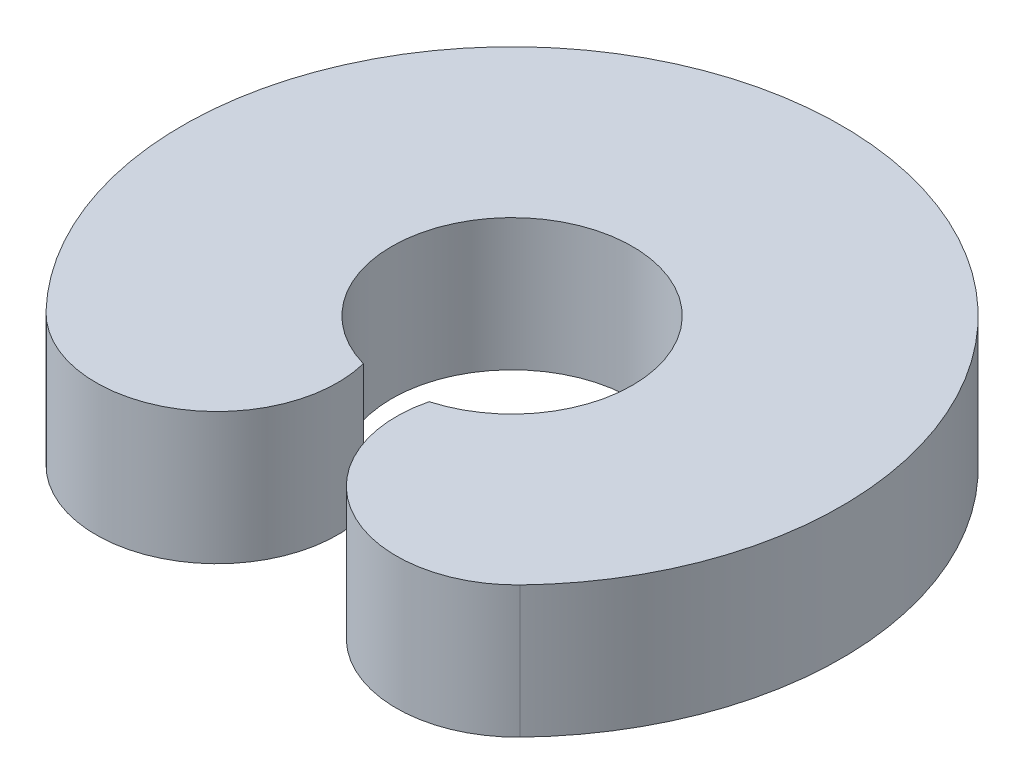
ISO-10303-21;
HEADER;
FILE_DESCRIPTION(('STEP AP214'),'2;1');
FILE_NAME('part.step','',(''),(''),'','','');
FILE_SCHEMA(('AUTOMOTIVE_DESIGN { 1 0 10303 214 1 1 1 1 }'));
ENDSEC;
DATA;
#1=APPLICATION_CONTEXT('core data for automotive mechanical design processes');
#2=APPLICATION_PROTOCOL_DEFINITION('international standard','automotive_design',2000,#1);
#3=PRODUCT_CONTEXT('',#1,'mechanical');
#4=PRODUCT('Part','Part','',(#3));
#5=PRODUCT_RELATED_PRODUCT_CATEGORY('part','',(#4));
#6=PRODUCT_DEFINITION_FORMATION('','',#4);
#7=PRODUCT_DEFINITION_CONTEXT('part definition',#1,'design');
#8=PRODUCT_DEFINITION('design','',#6,#7);
#9=PRODUCT_DEFINITION_SHAPE('','',#8);
#10=(LENGTH_UNIT() NAMED_UNIT(*) SI_UNIT(.MILLI.,.METRE.));
#11=(NAMED_UNIT(*) PLANE_ANGLE_UNIT() SI_UNIT($,.RADIAN.));
#12=(NAMED_UNIT(*) SI_UNIT($,.STERADIAN.) SOLID_ANGLE_UNIT());
#13=UNCERTAINTY_MEASURE_WITH_UNIT(LENGTH_MEASURE(1.E-05),#10,'distance_accuracy_value','');
#14=(GEOMETRIC_REPRESENTATION_CONTEXT(3) GLOBAL_UNCERTAINTY_ASSIGNED_CONTEXT((#13)) GLOBAL_UNIT_ASSIGNED_CONTEXT((#10,
#11,#12)) REPRESENTATION_CONTEXT('',''));
#15=CARTESIAN_POINT('',(0.,0.,0.));
#16=DIRECTION('',(0.,0.,1.));
#17=DIRECTION('',(1.,0.,0.));
#18=AXIS2_PLACEMENT_3D('',#15,#16,#17);
#19=CARTESIAN_POINT('',(-341.686405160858,300.,329.962725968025));
#20=DIRECTION('',(0.,-1.,0.));
#21=DIRECTION('',(0.,0.,-1.));
#22=AXIS2_PLACEMENT_3D('',#19,#20,#21);
#23=CYLINDRICAL_SURFACE('',#22,275.);
#24=CARTESIAN_POINT('',(-341.686405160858,0.,329.962725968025));
#25=DIRECTION('',(0.,1.,0.));
#26=DIRECTION('',(0.,0.,1.));
#27=AXIS2_PLACEMENT_3D('',#24,#25,#26);
#28=CIRCLE('',#27,275.);
#29=CARTESIAN_POINT('',(-539.504850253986,0.,520.993777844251));
#30=VERTEX_POINT('',#29);
#31=CARTESIAN_POINT('',(-74.8550804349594,0.,263.434204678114));
#32=VERTEX_POINT('',#31);
#33=EDGE_CURVE('E98',#30,#32,#28,.T.);
#34=ORIENTED_EDGE('',*,*,#33,.T.);
#35=DIRECTION('',(0.,-1.,0.));
#36=VECTOR('',#35,1.);
#37=CARTESIAN_POINT('',(-74.8550804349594,300.,263.434204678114));
#38=LINE('',#37,#36);
#39=CARTESIAN_POINT('',(-74.8550804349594,300.,263.434204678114));
#40=VERTEX_POINT('',#39);
#41=EDGE_CURVE('E11',#40,#32,#38,.T.);
#42=ORIENTED_EDGE('',*,*,#41,.F.);
#43=CARTESIAN_POINT('',(-341.686405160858,300.,329.962725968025));
#44=DIRECTION('',(0.,1.,0.));
#45=DIRECTION('',(0.,0.,1.));
#46=AXIS2_PLACEMENT_3D('',#43,#44,#45);
#47=CIRCLE('',#46,275.);
#48=CARTESIAN_POINT('',(-539.504850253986,300.,520.993777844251));
#49=VERTEX_POINT('',#48);
#50=EDGE_CURVE('E86',#49,#40,#47,.T.);
#51=ORIENTED_EDGE('',*,*,#50,.F.);
#52=DIRECTION('',(0.,-1.,0.));
#53=VECTOR('',#52,1.);
#54=CARTESIAN_POINT('',(-539.504850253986,300.,520.993777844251));
#55=LINE('',#54,#53);
#56=EDGE_CURVE('E94',#49,#30,#55,.T.);
#57=ORIENTED_EDGE('',*,*,#56,.T.);
#58=EDGE_LOOP('',(#34,#42,#51,#57));
#59=FACE_BOUND('',#58,.T.);
#60=ADVANCED_FACE('F35',(#59),#23,.T.);
#61=CARTESIAN_POINT('',(0.,300.,0.));
#62=DIRECTION('',(0.,-1.,0.));
#63=DIRECTION('',(0.,0.,-1.));
#64=AXIS2_PLACEMENT_3D('',#61,#62,#63);
#65=CYLINDRICAL_SURFACE('',#64,273.862854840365);
#66=CARTESIAN_POINT('',(0.,0.,0.));
#67=DIRECTION('',(0.,-1.,0.));
#68=DIRECTION('',(0.,0.,1.));
#69=AXIS2_PLACEMENT_3D('',#66,#67,#68);
#70=CIRCLE('',#69,273.862854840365);
#71=CARTESIAN_POINT('',(74.8550804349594,0.,263.434204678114));
#72=VERTEX_POINT('',#71);
#73=EDGE_CURVE('E90',#32,#72,#70,.T.);
#74=ORIENTED_EDGE('',*,*,#73,.T.);
#75=DIRECTION('',(0.,-1.,0.));
#76=VECTOR('',#75,1.);
#77=CARTESIAN_POINT('',(74.8550804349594,300.,263.434204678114));
#78=LINE('',#77,#76);
#79=CARTESIAN_POINT('',(74.8550804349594,300.,263.434204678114));
#80=VERTEX_POINT('',#79);
#81=EDGE_CURVE('E43',#80,#72,#78,.T.);
#82=ORIENTED_EDGE('',*,*,#81,.F.);
#83=CARTESIAN_POINT('',(0.,300.,0.));
#84=DIRECTION('',(0.,-1.,0.));
#85=DIRECTION('',(0.,0.,1.));
#86=AXIS2_PLACEMENT_3D('',#83,#84,#85);
#87=CIRCLE('',#86,273.862854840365);
#88=EDGE_CURVE('E81',#40,#80,#87,.T.);
#89=ORIENTED_EDGE('',*,*,#88,.F.);
#90=ORIENTED_EDGE('',*,*,#41,.T.);
#91=EDGE_LOOP('',(#74,#82,#89,#90));
#92=FACE_BOUND('',#91,.T.);
#93=ADVANCED_FACE('F89',(#92),#65,.F.);
#94=CARTESIAN_POINT('',(341.686405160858,300.,329.962725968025));
#95=DIRECTION('',(0.,-1.,0.));
#96=DIRECTION('',(0.,0.,-1.));
#97=AXIS2_PLACEMENT_3D('',#94,#95,#96);
#98=CYLINDRICAL_SURFACE('',#97,275.);
#99=CARTESIAN_POINT('',(341.686405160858,0.,329.962725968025));
#100=DIRECTION('',(0.,1.,0.));
#101=DIRECTION('',(0.,0.,1.));
#102=AXIS2_PLACEMENT_3D('',#99,#100,#101);
#103=CIRCLE('',#102,275.);
#104=CARTESIAN_POINT('',(539.504850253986,0.,520.993777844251));
#105=VERTEX_POINT('',#104);
#106=EDGE_CURVE('E68',#72,#105,#103,.T.);
#107=ORIENTED_EDGE('',*,*,#106,.T.);
#108=DIRECTION('',(0.,-1.,0.));
#109=VECTOR('',#108,1.);
#110=CARTESIAN_POINT('',(539.504850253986,300.,520.993777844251));
#111=LINE('',#110,#109);
#112=CARTESIAN_POINT('',(539.504850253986,300.,520.993777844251));
#113=VERTEX_POINT('',#112);
#114=EDGE_CURVE('E91',#113,#105,#111,.T.);
#115=ORIENTED_EDGE('',*,*,#114,.F.);
#116=CARTESIAN_POINT('',(341.686405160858,300.,329.962725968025));
#117=DIRECTION('',(0.,1.,0.));
#118=DIRECTION('',(0.,0.,1.));
#119=AXIS2_PLACEMENT_3D('',#116,#117,#118);
#120=CIRCLE('',#119,275.);
#121=EDGE_CURVE('E84',#80,#113,#120,.T.);
#122=ORIENTED_EDGE('',*,*,#121,.F.);
#123=ORIENTED_EDGE('',*,*,#81,.T.);
#124=EDGE_LOOP('',(#107,#115,#122,#123));
#125=FACE_BOUND('',#124,.T.);
#126=ADVANCED_FACE('F92',(#125),#98,.T.);
#127=CARTESIAN_POINT('',(0.,300.,0.));
#128=DIRECTION('',(0.,-1.,0.));
#129=DIRECTION('',(0.,0.,-1.));
#130=AXIS2_PLACEMENT_3D('',#127,#128,#129);
#131=CYLINDRICAL_SURFACE('',#130,750.);
#132=CARTESIAN_POINT('',(0.,0.,0.));
#133=DIRECTION('',(0.,1.,0.));
#134=DIRECTION('',(0.,0.,1.));
#135=AXIS2_PLACEMENT_3D('',#132,#133,#134);
#136=CIRCLE('',#135,750.);
#137=EDGE_CURVE('E74',#105,#30,#136,.T.);
#138=ORIENTED_EDGE('',*,*,#137,.T.);
#139=ORIENTED_EDGE('',*,*,#56,.F.);
#140=CARTESIAN_POINT('',(0.,300.,0.));
#141=DIRECTION('',(0.,1.,0.));
#142=DIRECTION('',(0.,0.,1.));
#143=AXIS2_PLACEMENT_3D('',#140,#141,#142);
#144=CIRCLE('',#143,750.);
#145=EDGE_CURVE('E51',#113,#49,#144,.T.);
#146=ORIENTED_EDGE('',*,*,#145,.F.);
#147=ORIENTED_EDGE('',*,*,#114,.T.);
#148=EDGE_LOOP('',(#138,#139,#146,#147));
#149=FACE_BOUND('',#148,.T.);
#150=ADVANCED_FACE('F105',(#149),#131,.T.);
#151=CARTESIAN_POINT('',(-170.843202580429,300.,164.981362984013));
#152=DIRECTION('',(0.,1.,0.));
#153=DIRECTION('',(0.,0.,1.));
#154=AXIS2_PLACEMENT_3D('',#151,#152,#153);
#155=PLANE('',#154);
#156=ORIENTED_EDGE('',*,*,#50,.T.);
#157=ORIENTED_EDGE('',*,*,#88,.T.);
#158=ORIENTED_EDGE('',*,*,#121,.T.);
#159=ORIENTED_EDGE('',*,*,#145,.T.);
#160=EDGE_LOOP('',(#156,#157,#158,#159));
#161=FACE_BOUND('',#160,.T.);
#162=ADVANCED_FACE('F82',(#161),#155,.T.);
#163=CARTESIAN_POINT('',(-170.843202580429,0.,164.981362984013));
#164=DIRECTION('',(0.,1.,0.));
#165=DIRECTION('',(0.,0.,1.));
#166=AXIS2_PLACEMENT_3D('',#163,#164,#165);
#167=PLANE('',#166);
#168=ORIENTED_EDGE('',*,*,#33,.F.);
#169=ORIENTED_EDGE('',*,*,#137,.F.);
#170=ORIENTED_EDGE('',*,*,#106,.F.);
#171=ORIENTED_EDGE('',*,*,#73,.F.);
#172=EDGE_LOOP('',(#168,#169,#170,#171));
#173=FACE_BOUND('',#172,.T.);
#174=ADVANCED_FACE('F108',(#173),#167,.F.);
#175=CLOSED_SHELL('',(#60,#93,#126,#150,#162,#174));
#176=MANIFOLD_SOLID_BREP('B2',#175);
#177=ADVANCED_BREP_SHAPE_REPRESENTATION('',(#18,#176),#14);
#178=SHAPE_DEFINITION_REPRESENTATION(#9,#177);
ENDSEC;
END-ISO-10303-21;
